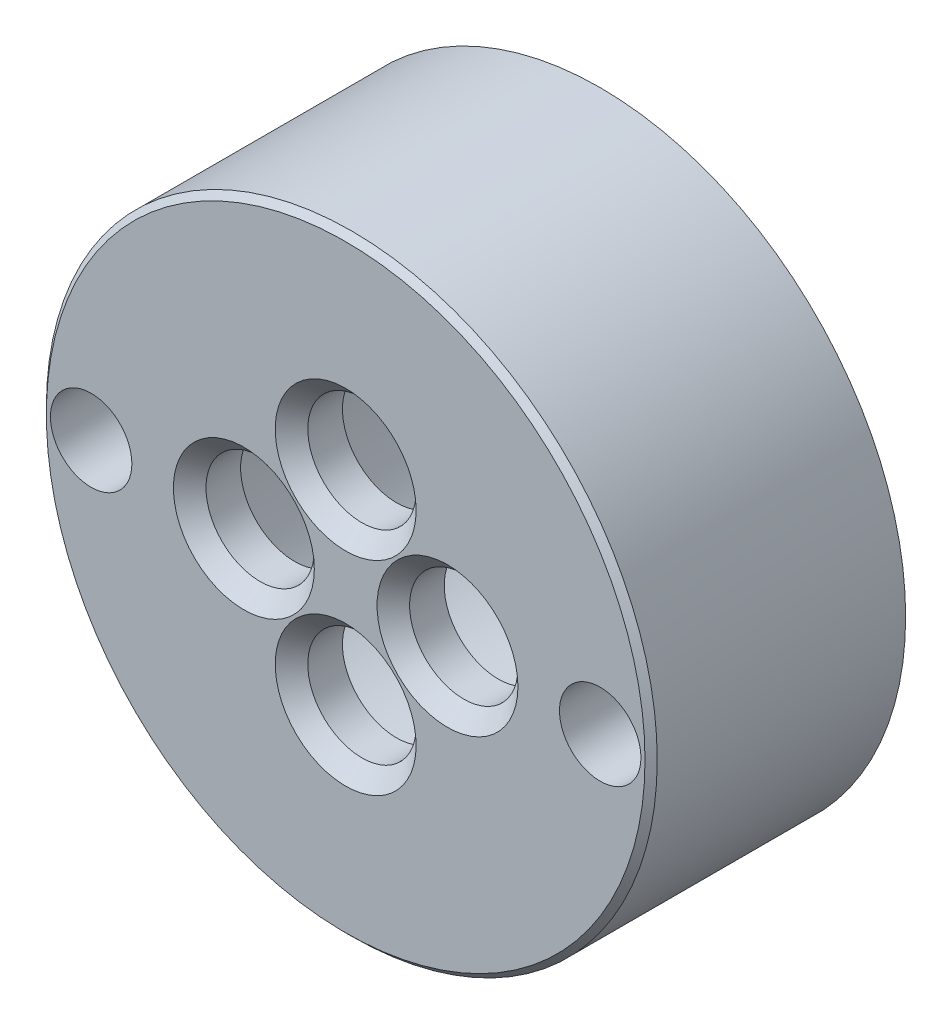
from build123d import *

# Parameters (mm, degrees)
SKETCH1_R         = 19.05
SKETCH1_R_2       = 11.1125
BODY_DEPTH        = 12.7
SKETCH2_R         = 19.05
TOP_DEPTH         = 3.175
SKETCH3_R         = 2.54
MOUNT_HOLES_DEPTH = 172.004497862
SKETCH4_R         = 3.3782
VENT_HOLES_DEPTH  = 172.004497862
OUTER_EDGE_SIZE   = 0.381
VENT_SIZE         = 1.016


with BuildPart() as part:
    # Sketch1 → body (new body)
    with BuildSketch(Plane.XY):
        with Locations((-101.092, -101.6)):
            Circle(SKETCH1_R)
        with Locations((-101.092, -101.6)):
            Circle(SKETCH1_R_2, mode=Mode.SUBTRACT)
    extrude(amount=BODY_DEPTH)

    # Sketch2 → top (add)
    with BuildSketch(Plane.XY.offset(12.7)):
        with Locations((-101.092, -101.6)):
            Circle(SKETCH2_R)
    extrude(amount=TOP_DEPTH)

    # Sketch3 → mount holes (cut, through all)
    with BuildSketch(Plane.XY.offset(15.875)):
        with Locations((-116.967, -101.6)):
            Circle(SKETCH3_R)
        with Locations((-85.217, -101.6)):
            Circle(SKETCH3_R)
    extrude(amount=-MOUNT_HOLES_DEPTH, mode=Mode.SUBTRACT)

    # Sketch4 → vent holes (cut, through all)
    with BuildSketch(Plane.XY.offset(15.875)):
        with Locations((-94.742, -101.6)):
            Circle(SKETCH4_R)
        with Locations((-101.092, -107.95)):
            Circle(SKETCH4_R)
        with Locations((-107.442, -101.6)):
            Circle(SKETCH4_R)
        with Locations((-101.092, -95.25)):
            Circle(SKETCH4_R)
    extrude(amount=-VENT_HOLES_DEPTH, mode=Mode.SUBTRACT)

    # outer edge
    outer_edge_edges = [part.edges().sort_by_distance(p)[0] for p in [
        (-120.142, -101.6, 15.875),
    ]]
    chamfer(outer_edge_edges, length=OUTER_EDGE_SIZE)

    # vent
    vent_edges = [part.edges().sort_by_distance(p)[0] for p in [
        (-98.1202, -101.6, 15.875),
        (-104.4702, -107.95, 15.875),
        (-110.8202, -101.6, 15.875),
        (-104.4702, -95.25, 15.875),
    ]]
    chamfer(vent_edges, length=VENT_SIZE)


solid = part.part
